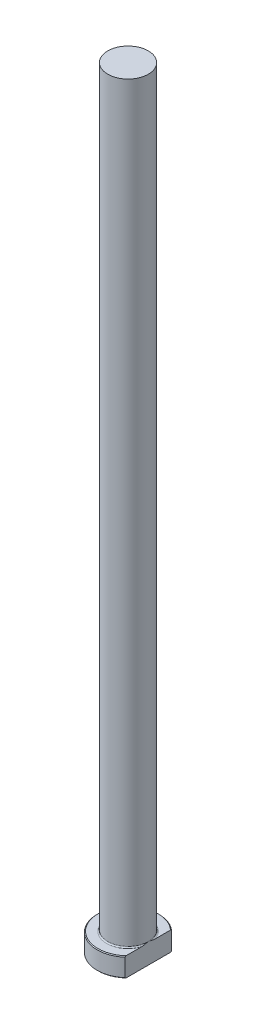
ISO-10303-21;
HEADER;
FILE_DESCRIPTION(('STEP AP214'),'2;1');
FILE_NAME('part.step','',(''),(''),'','','');
FILE_SCHEMA(('AUTOMOTIVE_DESIGN { 1 0 10303 214 1 1 1 1 }'));
ENDSEC;
DATA;
#1=APPLICATION_CONTEXT('core data for automotive mechanical design processes');
#2=APPLICATION_PROTOCOL_DEFINITION('international standard','automotive_design',2000,#1);
#3=PRODUCT_CONTEXT('',#1,'mechanical');
#4=PRODUCT('Part','Part','',(#3));
#5=PRODUCT_RELATED_PRODUCT_CATEGORY('part','',(#4));
#6=PRODUCT_DEFINITION_FORMATION('','',#4);
#7=PRODUCT_DEFINITION_CONTEXT('part definition',#1,'design');
#8=PRODUCT_DEFINITION('design','',#6,#7);
#9=PRODUCT_DEFINITION_SHAPE('','',#8);
#10=(LENGTH_UNIT() NAMED_UNIT(*) SI_UNIT(.MILLI.,.METRE.));
#11=(NAMED_UNIT(*) PLANE_ANGLE_UNIT() SI_UNIT($,.RADIAN.));
#12=(NAMED_UNIT(*) SI_UNIT($,.STERADIAN.) SOLID_ANGLE_UNIT());
#13=UNCERTAINTY_MEASURE_WITH_UNIT(LENGTH_MEASURE(1.E-05),#10,'distance_accuracy_value','');
#14=(GEOMETRIC_REPRESENTATION_CONTEXT(3) GLOBAL_UNCERTAINTY_ASSIGNED_CONTEXT((#13)) GLOBAL_UNIT_ASSIGNED_CONTEXT((#10,
#11,#12)) REPRESENTATION_CONTEXT('',''));
#15=CARTESIAN_POINT('',(0.,0.,0.));
#16=DIRECTION('',(0.,0.,1.));
#17=DIRECTION('',(1.,0.,0.));
#18=AXIS2_PLACEMENT_3D('',#15,#16,#17);
#19=CARTESIAN_POINT('',(0.,0.,0.));
#20=DIRECTION('',(0.,-1.,0.));
#21=DIRECTION('',(0.,0.,-1.));
#22=AXIS2_PLACEMENT_3D('',#19,#20,#21);
#23=PLANE('',#22);
#24=CARTESIAN_POINT('',(0.,0.,0.));
#25=DIRECTION('',(0.,-1.,0.));
#26=DIRECTION('',(0.,0.,-1.));
#27=AXIS2_PLACEMENT_3D('',#24,#25,#26);
#28=CIRCLE('',#27,7.79999999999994);
#29=CARTESIAN_POINT('',(5.24999999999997,0.,5.76866535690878));
#30=VERTEX_POINT('',#29);
#31=CARTESIAN_POINT('',(5.24999999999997,0.,-5.76866535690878));
#32=VERTEX_POINT('',#31);
#33=EDGE_CURVE('E98',#30,#32,#28,.T.);
#34=ORIENTED_EDGE('',*,*,#33,.T.);
#35=DIRECTION('',(0.,0.,1.));
#36=VECTOR('',#35,1.);
#37=CARTESIAN_POINT('',(5.24999999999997,0.,-6.0363482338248));
#38=LINE('',#37,#36);
#39=EDGE_CURVE('E83',#32,#30,#38,.T.);
#40=ORIENTED_EDGE('',*,*,#39,.T.);
#41=EDGE_LOOP('',(#34,#40));
#42=FACE_BOUND('',#41,.T.);
#43=ADVANCED_FACE('F32',(#42),#23,.T.);
#44=CARTESIAN_POINT('',(0.,259.958771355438,0.));
#45=DIRECTION('',(0.,1.,0.));
#46=DIRECTION('',(0.,0.,1.));
#47=AXIS2_PLACEMENT_3D('',#44,#45,#46);
#48=CYLINDRICAL_SURFACE('',#47,7.99999999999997);
#49=CARTESIAN_POINT('',(0.,4.80000000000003,0.));
#50=DIRECTION('',(0.,1.,0.));
#51=DIRECTION('',(0.,0.,1.));
#52=AXIS2_PLACEMENT_3D('',#49,#50,#51);
#53=CIRCLE('',#52,7.99999999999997);
#54=CARTESIAN_POINT('',(5.24999999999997,4.80000000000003,6.0363482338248));
#55=VERTEX_POINT('',#54);
#56=CARTESIAN_POINT('',(5.24999999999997,4.80000000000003,-6.0363482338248));
#57=VERTEX_POINT('',#56);
#58=EDGE_CURVE('E104',#55,#57,#53,.F.);
#59=ORIENTED_EDGE('',*,*,#58,.T.);
#60=DIRECTION('',(0.,-1.,0.));
#61=VECTOR('',#60,1.);
#62=CARTESIAN_POINT('',(5.24999999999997,200.,-6.0363482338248));
#63=LINE('',#62,#61);
#64=CARTESIAN_POINT('',(5.24999999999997,0.200000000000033,-6.0363482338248));
#65=VERTEX_POINT('',#64);
#66=EDGE_CURVE('E183',#57,#65,#63,.T.);
#67=ORIENTED_EDGE('',*,*,#66,.T.);
#68=CARTESIAN_POINT('',(0.,0.200000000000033,0.));
#69=DIRECTION('',(0.,-1.,0.));
#70=DIRECTION('',(0.,0.,-1.));
#71=AXIS2_PLACEMENT_3D('',#68,#69,#70);
#72=CIRCLE('',#71,7.99999999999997);
#73=CARTESIAN_POINT('',(5.24999999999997,0.200000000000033,6.0363482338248));
#74=VERTEX_POINT('',#73);
#75=EDGE_CURVE('E100',#65,#74,#72,.F.);
#76=ORIENTED_EDGE('',*,*,#75,.T.);
#77=DIRECTION('',(0.,-1.,0.));
#78=VECTOR('',#77,1.);
#79=CARTESIAN_POINT('',(5.24999999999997,200.,6.0363482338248));
#80=LINE('',#79,#78);
#81=EDGE_CURVE('E93',#55,#74,#80,.T.);
#82=ORIENTED_EDGE('',*,*,#81,.F.);
#83=EDGE_LOOP('',(#59,#67,#76,#82));
#84=FACE_BOUND('',#83,.T.);
#85=ADVANCED_FACE('F158',(#84),#48,.T.);
#86=CARTESIAN_POINT('',(-7.99999999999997,5.,0.));
#87=DIRECTION('',(0.,1.,0.));
#88=DIRECTION('',(0.,0.,1.));
#89=AXIS2_PLACEMENT_3D('',#86,#87,#88);
#90=PLANE('',#89);
#91=CARTESIAN_POINT('',(0.,5.,0.));
#92=DIRECTION('',(0.,1.,0.));
#93=DIRECTION('',(0.,0.,1.));
#94=AXIS2_PLACEMENT_3D('',#91,#92,#93);
#95=CIRCLE('',#94,7.79999999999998);
#96=CARTESIAN_POINT('',(5.24999999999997,5.,-5.76866535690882));
#97=VERTEX_POINT('',#96);
#98=CARTESIAN_POINT('',(5.24999999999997,5.,5.76866535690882));
#99=VERTEX_POINT('',#98);
#100=EDGE_CURVE('E178',#97,#99,#95,.T.);
#101=ORIENTED_EDGE('',*,*,#100,.T.);
#102=DIRECTION('',(0.,0.,-1.));
#103=VECTOR('',#102,1.);
#104=CARTESIAN_POINT('',(5.24999999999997,5.,0.));
#105=LINE('',#104,#103);
#106=CARTESIAN_POINT('',(5.24999999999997,4.99999999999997,1.79999999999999));
#107=VERTEX_POINT('',#106);
#108=EDGE_CURVE('E57',#99,#107,#105,.T.);
#109=ORIENTED_EDGE('',*,*,#108,.T.);
#110=CARTESIAN_POINT('',(0.,5.,0.));
#111=DIRECTION('',(0.,1.,0.));
#112=DIRECTION('',(0.,0.,1.));
#113=AXIS2_PLACEMENT_3D('',#110,#111,#112);
#114=CIRCLE('',#113,5.54999999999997);
#115=CARTESIAN_POINT('',(5.24999999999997,4.99999999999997,-1.79999999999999));
#116=VERTEX_POINT('',#115);
#117=EDGE_CURVE('E107',#107,#116,#114,.F.);
#118=ORIENTED_EDGE('',*,*,#117,.T.);
#119=EDGE_CURVE('E136',#116,#97,#105,.T.);
#120=ORIENTED_EDGE('',*,*,#119,.T.);
#121=EDGE_LOOP('',(#101,#109,#118,#120));
#122=FACE_BOUND('',#121,.T.);
#123=ADVANCED_FACE('F147',(#122),#90,.T.);
#124=CARTESIAN_POINT('',(0.,5.,0.));
#125=DIRECTION('',(0.,-1.,0.));
#126=DIRECTION('',(0.,0.,-1.));
#127=AXIS2_PLACEMENT_3D('',#124,#125,#126);
#128=CONICAL_SURFACE('',#127,7.79999999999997,0.785398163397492);
#129=ORIENTED_EDGE('',*,*,#58,.F.);
#130=CARTESIAN_POINT('',(5.24999999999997,-1.48116632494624,13.2811600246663));
#131=CARTESIAN_POINT('',(5.24999999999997,-1.29357250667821,13.0794377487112));
#132=CARTESIAN_POINT('',(5.24999999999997,-1.10628451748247,12.8774311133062));
#133=CARTESIAN_POINT('',(5.24999999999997,-0.732415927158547,12.4727618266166));
#134=CARTESIAN_POINT('',(5.24999999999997,-0.545835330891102,12.2700991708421));
#135=CARTESIAN_POINT('',(5.24999999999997,0.0127787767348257,11.6609122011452));
#136=CARTESIAN_POINT('',(5.24999999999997,0.383603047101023,11.2532764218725));
#137=CARTESIAN_POINT('',(5.24999999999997,1.12325341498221,10.4315008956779));
#138=CARTESIAN_POINT('',(5.24999999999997,1.49205195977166,10.017336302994));
#139=CARTESIAN_POINT('',(5.24999999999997,2.22349880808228,9.18368237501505));
#140=CARTESIAN_POINT('',(5.24999999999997,2.58614786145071,8.7641936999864));
#141=CARTESIAN_POINT('',(5.24999999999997,3.2300874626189,8.00331710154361));
#142=CARTESIAN_POINT('',(5.24999999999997,3.51299211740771,7.66330157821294));
#143=CARTESIAN_POINT('',(5.24999999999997,3.93141579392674,7.1483720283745));
#144=CARTESIAN_POINT('',(5.24999999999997,4.06992138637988,6.97588542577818));
#145=CARTESIAN_POINT('',(5.24999999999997,4.34452705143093,6.62901010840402));
#146=CARTESIAN_POINT('',(5.24999999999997,4.48062717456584,6.45462143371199));
#147=CARTESIAN_POINT('',(5.24999999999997,4.74973822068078,6.10383934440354));
#148=CARTESIAN_POINT('',(5.24999999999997,4.88275300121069,5.92744889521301));
#149=CARTESIAN_POINT('',(5.24999999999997,5.14521399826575,5.57203856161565));
#150=CARTESIAN_POINT('',(5.24999999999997,5.27466038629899,5.39301880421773));
#151=CARTESIAN_POINT('',(5.24999999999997,5.5290748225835,5.03192492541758));
#152=CARTESIAN_POINT('',(5.24999999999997,5.65404469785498,4.84985209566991));
#153=CARTESIAN_POINT('',(5.24999999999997,5.89840426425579,4.48201214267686));
#154=CARTESIAN_POINT('',(5.24999999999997,6.01779462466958,4.29624546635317));
#155=CARTESIAN_POINT('',(5.24999999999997,6.24171029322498,3.93290441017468));
#156=CARTESIAN_POINT('',(5.24999999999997,6.34669562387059,3.75561494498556));
#157=CARTESIAN_POINT('',(5.24999999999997,6.5488301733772,3.39656407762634));
#158=CARTESIAN_POINT('',(5.24999999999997,6.64597853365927,3.21480218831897));
#159=CARTESIAN_POINT('',(5.24999999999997,6.83020392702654,2.84629933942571));
#160=CARTESIAN_POINT('',(5.24999999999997,6.91728535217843,2.65956059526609));
#161=CARTESIAN_POINT('',(5.24999999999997,7.07861709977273,2.28058919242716));
#162=CARTESIAN_POINT('',(5.24999999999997,7.15287080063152,2.08835799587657));
#163=CARTESIAN_POINT('',(5.24999999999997,7.27107095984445,1.73993363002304));
#164=CARTESIAN_POINT('',(5.24999999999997,7.31810380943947,1.58479376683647));
#165=CARTESIAN_POINT('',(5.24999999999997,7.40035184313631,1.27142880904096));
#166=CARTESIAN_POINT('',(5.24999999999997,7.43557139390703,1.11320487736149));
#167=CARTESIAN_POINT('',(5.24999999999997,7.49247262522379,0.794842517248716));
#168=CARTESIAN_POINT('',(5.24999999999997,7.5141983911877,0.634712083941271));
#169=CARTESIAN_POINT('',(5.24999999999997,7.5431070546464,0.313132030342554));
#170=CARTESIAN_POINT('',(5.24999999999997,7.55029089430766,0.151682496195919));
#171=CARTESIAN_POINT('',(5.24999999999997,7.54968998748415,-0.1717266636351));
#172=CARTESIAN_POINT('',(5.24999999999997,7.54185529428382,-0.333686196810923));
#173=CARTESIAN_POINT('',(5.24999999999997,7.5115849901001,-0.656223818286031));
#174=CARTESIAN_POINT('',(5.24999999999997,7.48914825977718,-0.816801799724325));
#175=CARTESIAN_POINT('',(5.24999999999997,7.43080718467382,-1.13597880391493));
#176=CARTESIAN_POINT('',(5.24999999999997,7.39486058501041,-1.29456998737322));
#177=CARTESIAN_POINT('',(5.24999999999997,7.31118363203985,-1.60857875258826));
#178=CARTESIAN_POINT('',(5.24999999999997,7.26345259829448,-1.76399615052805));
#179=CARTESIAN_POINT('',(5.24999999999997,7.15315151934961,-2.08548717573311));
#180=CARTESIAN_POINT('',(5.24999999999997,7.08962117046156,-2.25122835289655));
#181=CARTESIAN_POINT('',(5.24999999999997,6.95279918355,-2.57864196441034));
#182=CARTESIAN_POINT('',(5.24999999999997,6.87950469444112,-2.74031319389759));
#183=CARTESIAN_POINT('',(5.24999999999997,6.72489088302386,-3.06007692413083));
#184=CARTESIAN_POINT('',(5.24999999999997,6.64355831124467,-3.21816296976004));
#185=CARTESIAN_POINT('',(5.24999999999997,6.47449809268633,-3.53083072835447));
#186=CARTESIAN_POINT('',(5.24999999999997,6.38677122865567,-3.68541286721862));
#187=CARTESIAN_POINT('',(5.24999999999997,6.20495786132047,-3.99346169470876));
#188=CARTESIAN_POINT('',(5.24999999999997,6.110804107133,-4.14688850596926));
#189=CARTESIAN_POINT('',(5.24999999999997,5.91814750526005,-4.45098066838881));
#190=CARTESIAN_POINT('',(5.24999999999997,5.81964456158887,-4.60164595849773));
#191=CARTESIAN_POINT('',(5.24999999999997,5.61916095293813,-4.90042904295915));
#192=CARTESIAN_POINT('',(5.24999999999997,5.51718369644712,-5.04854913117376));
#193=CARTESIAN_POINT('',(5.24999999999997,5.31027155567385,-5.3427009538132));
#194=CARTESIAN_POINT('',(5.24999999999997,5.20533670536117,-5.48873271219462));
#195=CARTESIAN_POINT('',(5.24999999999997,4.97106981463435,-5.80895105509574));
#196=CARTESIAN_POINT('',(5.24999999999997,4.84117419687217,-5.98272485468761));
#197=CARTESIAN_POINT('',(5.24999999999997,4.57844088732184,-6.32803694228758));
#198=CARTESIAN_POINT('',(5.24999999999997,4.44560309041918,-6.49957515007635));
#199=CARTESIAN_POINT('',(5.24999999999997,4.04344241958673,-7.01138747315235));
#200=CARTESIAN_POINT('',(5.24999999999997,3.77050218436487,-7.34881891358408));
#201=CARTESIAN_POINT('',(5.24999999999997,3.21761339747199,-8.01842681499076));
#202=CARTESIAN_POINT('',(5.24999999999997,2.93765803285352,-8.35059761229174));
#203=CARTESIAN_POINT('',(5.24999999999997,2.37280482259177,-9.01071908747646));
#204=CARTESIAN_POINT('',(5.24999999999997,2.08790682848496,-9.338669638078));
#205=CARTESIAN_POINT('',(5.24999999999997,1.53221513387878,-9.97104652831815));
#206=CARTESIAN_POINT('',(5.24999999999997,1.26164416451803,-10.2756690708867));
#207=CARTESIAN_POINT('',(5.24999999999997,0.717945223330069,-10.8826342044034));
#208=CARTESIAN_POINT('',(5.24999999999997,0.44481719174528,-11.184976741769));
#209=CARTESIAN_POINT('',(5.24999999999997,-0.102863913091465,-11.7871569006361));
#210=CARTESIAN_POINT('',(5.24999999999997,-0.377412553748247,-12.0869985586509));
#211=CARTESIAN_POINT('',(5.24999999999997,-0.928148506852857,-12.6851474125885));
#212=CARTESIAN_POINT('',(5.24999999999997,-1.20433574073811,-12.9834546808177));
#213=CARTESIAN_POINT('',(5.24999999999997,-1.48116632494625,-13.2811600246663));
#214=B_SPLINE_CURVE_WITH_KNOTS('',3,(#130,#131,#132,#133,#134,#135,#136,#137,#138,#139,#140,
#141,#142,#143,#144,#145,#146,#147,#148,#149,#150,#151,#152,#153,#154,#155,#156,#157,#158,#159,
#160,#161,#162,#163,#164,#165,#166,#167,#168,#169,#170,#171,#172,#173,#174,#175,#176,#177,#178,
#179,#180,#181,#182,#183,#184,#185,#186,#187,#188,#189,#190,#191,#192,#193,#194,#195,#196,#197,
#198,#199,#200,#201,#202,#203,#204,#205,#206,#207,#208,#209,#210,#211,#212,#213),.UNSPECIFIED.,
.F.,.F.,(4,2,2,2,2,2,2,2,2,2,2,2,2,2,2,2,2,2,2,2,2,2,2,2,2,2,2,2,2,2,2,2,2,2,2,2,2,2,2,2,2,4),
(0.,0.826407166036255,1.65282000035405,3.30600459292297,4.9696651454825,6.63312135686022,
7.9599789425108,8.62360280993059,9.2872127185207,9.94994254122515,10.6126404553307,
11.2750647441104,11.9374093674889,12.555381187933,13.1734206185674,13.7911893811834,
14.4087951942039,14.8947423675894,15.3805097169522,15.8646815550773,16.3488220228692,
16.8345753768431,17.3203659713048,17.8076887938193,18.2950397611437,18.8271554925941,
19.3594269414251,19.8925908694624,20.4256896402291,20.9656407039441,21.5056036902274,
22.0450513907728,22.5844928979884,23.2353229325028,23.8861762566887,25.1880335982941,
26.4912084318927,27.7944224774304,29.0167115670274,30.2390292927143,31.4586693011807,
32.6782512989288),.UNSPECIFIED.);
#215=EDGE_CURVE('E135',#55,#99,#214,.T.);
#216=ORIENTED_EDGE('',*,*,#215,.T.);
#217=ORIENTED_EDGE('',*,*,#100,.F.);
#218=EDGE_CURVE('E127',#97,#57,#214,.T.);
#219=ORIENTED_EDGE('',*,*,#218,.T.);
#220=EDGE_LOOP('',(#129,#216,#217,#219));
#221=FACE_BOUND('',#220,.T.);
#222=ADVANCED_FACE('F143',(#221),#128,.T.);
#223=CARTESIAN_POINT('',(0.,0.200000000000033,0.));
#224=DIRECTION('',(0.,1.,0.));
#225=DIRECTION('',(0.,0.,1.));
#226=AXIS2_PLACEMENT_3D('',#223,#224,#225);
#227=CONICAL_SURFACE('',#226,7.99999999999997,0.785398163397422);
#228=ORIENTED_EDGE('',*,*,#75,.F.);
#229=CARTESIAN_POINT('',(5.24999999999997,6.48116632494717,-13.2811600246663));
#230=CARTESIAN_POINT('',(5.24999999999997,6.29357250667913,-13.0794377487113));
#231=CARTESIAN_POINT('',(5.24999999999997,6.10628451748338,-12.8774311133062));
#232=CARTESIAN_POINT('',(5.24999999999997,5.73241592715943,-12.4727618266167));
#233=CARTESIAN_POINT('',(5.24999999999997,5.54583533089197,-12.2700991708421));
#234=CARTESIAN_POINT('',(5.24999999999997,4.98722122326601,-11.6609122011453));
#235=CARTESIAN_POINT('',(5.24999999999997,4.61639695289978,-11.2532764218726));
#236=CARTESIAN_POINT('',(5.24999999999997,3.87674658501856,-10.4315008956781));
#237=CARTESIAN_POINT('',(5.24999999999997,3.50794804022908,-10.0173363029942));
#238=CARTESIAN_POINT('',(5.24999999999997,2.77650119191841,-9.18368237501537));
#239=CARTESIAN_POINT('',(5.24999999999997,2.41385213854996,-8.76419369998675));
#240=CARTESIAN_POINT('',(5.24999999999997,1.76991253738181,-8.00331710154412));
#241=CARTESIAN_POINT('',(5.24999999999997,1.48700788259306,-7.66330157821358));
#242=CARTESIAN_POINT('',(5.24999999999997,1.06858420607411,-7.14837202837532));
#243=CARTESIAN_POINT('',(5.24999999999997,0.930078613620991,-6.97588542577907));
#244=CARTESIAN_POINT('',(5.24999999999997,0.655472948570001,-6.62901010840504));
#245=CARTESIAN_POINT('',(5.24999999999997,0.519372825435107,-6.45462143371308));
#246=CARTESIAN_POINT('',(5.24999999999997,0.250261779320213,-6.10383934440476));
#247=CARTESIAN_POINT('',(5.24999999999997,0.117246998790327,-5.9274488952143));
#248=CARTESIAN_POINT('',(5.24999999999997,-0.145213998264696,-5.57203856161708));
#249=CARTESIAN_POINT('',(5.24999999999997,-0.274660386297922,-5.39301880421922));
#250=CARTESIAN_POINT('',(5.24999999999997,-0.529074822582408,-5.03192492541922));
#251=CARTESIAN_POINT('',(5.24999999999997,-0.654044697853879,-4.84985209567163));
#252=CARTESIAN_POINT('',(5.24999999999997,-0.898404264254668,-4.48201214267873));
#253=CARTESIAN_POINT('',(5.24999999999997,-1.01779462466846,-4.29624546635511));
#254=CARTESIAN_POINT('',(5.24999999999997,-1.24171029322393,-3.93290441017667));
#255=CARTESIAN_POINT('',(5.24999999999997,-1.34669562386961,-3.75561494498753));
#256=CARTESIAN_POINT('',(5.24999999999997,-1.54883017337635,-3.39656407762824));
#257=CARTESIAN_POINT('',(5.24999999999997,-1.64597853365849,-3.21480218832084));
#258=CARTESIAN_POINT('',(5.24999999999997,-1.8302039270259,-2.84629933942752));
#259=CARTESIAN_POINT('',(5.24999999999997,-1.91728535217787,-2.65956059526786));
#260=CARTESIAN_POINT('',(5.24999999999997,-2.07861709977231,-2.28058919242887));
#261=CARTESIAN_POINT('',(5.24999999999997,-2.15287080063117,-2.08835799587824));
#262=CARTESIAN_POINT('',(5.24999999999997,-2.27107095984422,-1.73993363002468));
#263=CARTESIAN_POINT('',(5.24999999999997,-2.31810380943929,-1.58479376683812));
#264=CARTESIAN_POINT('',(5.24999999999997,-2.40035184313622,-1.27142880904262));
#265=CARTESIAN_POINT('',(5.24999999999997,-2.43557139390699,-1.11320487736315));
#266=CARTESIAN_POINT('',(5.24999999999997,-2.49247262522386,-0.794842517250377));
#267=CARTESIAN_POINT('',(5.24999999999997,-2.51419839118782,-0.63471208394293));
#268=CARTESIAN_POINT('',(5.24999999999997,-2.54310705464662,-0.313132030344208));
#269=CARTESIAN_POINT('',(5.24999999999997,-2.55029089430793,-0.151682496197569));
#270=CARTESIAN_POINT('',(5.24999999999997,-2.54968998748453,0.171726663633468));
#271=CARTESIAN_POINT('',(5.24999999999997,-2.54185529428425,0.333686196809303));
#272=CARTESIAN_POINT('',(5.24999999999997,-2.51158499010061,0.656223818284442));
#273=CARTESIAN_POINT('',(5.24999999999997,-2.48914825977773,0.816801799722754));
#274=CARTESIAN_POINT('',(5.24999999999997,-2.43080718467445,1.1359788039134));
#275=CARTESIAN_POINT('',(5.24999999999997,-2.39486058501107,1.2945699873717));
#276=CARTESIAN_POINT('',(5.24999999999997,-2.31118363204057,1.60857875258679));
#277=CARTESIAN_POINT('',(5.24999999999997,-2.26345259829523,1.7639961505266));
#278=CARTESIAN_POINT('',(5.24999999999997,-2.15315151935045,2.08548717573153));
#279=CARTESIAN_POINT('',(5.24999999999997,-2.0896211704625,2.25122835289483));
#280=CARTESIAN_POINT('',(5.24999999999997,-1.95279918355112,2.57864196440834));
#281=CARTESIAN_POINT('',(5.24999999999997,-1.87950469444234,2.74031319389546));
#282=CARTESIAN_POINT('',(5.24999999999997,-1.72489088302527,3.06007692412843));
#283=CARTESIAN_POINT('',(5.24999999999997,-1.64355831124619,3.21816296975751));
#284=CARTESIAN_POINT('',(5.24999999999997,-1.47449809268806,3.53083072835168));
#285=CARTESIAN_POINT('',(5.24999999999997,-1.38677122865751,3.68541286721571));
#286=CARTESIAN_POINT('',(5.24999999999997,-1.20495786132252,3.99346169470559));
#287=CARTESIAN_POINT('',(5.24999999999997,-1.11080410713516,4.14688850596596));
#288=CARTESIAN_POINT('',(5.24999999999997,-0.918147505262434,4.45098066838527));
#289=CARTESIAN_POINT('',(5.24999999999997,-0.81964456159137,4.60164595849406));
#290=CARTESIAN_POINT('',(5.24999999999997,-0.619160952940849,4.90042904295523));
#291=CARTESIAN_POINT('',(5.24999999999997,-0.517183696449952,5.04854913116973));
#292=CARTESIAN_POINT('',(5.24999999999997,-0.310271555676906,5.34270095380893));
#293=CARTESIAN_POINT('',(5.24999999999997,-0.205336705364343,5.48873271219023));
#294=CARTESIAN_POINT('',(5.24999999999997,0.0289301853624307,5.80895105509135));
#295=CARTESIAN_POINT('',(5.24999999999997,0.158825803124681,5.98272485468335));
#296=CARTESIAN_POINT('',(5.24999999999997,0.421559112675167,6.32803694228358));
#297=CARTESIAN_POINT('',(5.24999999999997,0.554396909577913,6.49957515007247));
#298=CARTESIAN_POINT('',(5.24999999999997,0.956557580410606,7.01138747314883));
#299=CARTESIAN_POINT('',(5.24999999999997,1.22949781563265,7.34881891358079));
#300=CARTESIAN_POINT('',(5.24999999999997,1.78238660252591,8.01842681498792));
#301=CARTESIAN_POINT('',(5.24999999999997,2.06234196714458,8.35059761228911));
#302=CARTESIAN_POINT('',(5.24999999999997,2.62719517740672,9.01071908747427));
#303=CARTESIAN_POINT('',(5.24999999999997,2.91209317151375,9.33866963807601));
#304=CARTESIAN_POINT('',(5.24999999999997,3.4677848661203,9.97104652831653));
#305=CARTESIAN_POINT('',(5.24999999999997,3.73835583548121,10.2756690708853));
#306=CARTESIAN_POINT('',(5.24999999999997,4.28205477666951,10.8826342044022));
#307=CARTESIAN_POINT('',(5.24999999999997,4.55518280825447,11.184976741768));
#308=CARTESIAN_POINT('',(5.24999999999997,5.10286391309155,11.7871569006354));
#309=CARTESIAN_POINT('',(5.24999999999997,5.3774125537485,12.0869985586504));
#310=CARTESIAN_POINT('',(5.24999999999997,5.92814850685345,12.6851474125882));
#311=CARTESIAN_POINT('',(5.24999999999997,6.20433574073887,12.9834546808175));
#312=CARTESIAN_POINT('',(5.24999999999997,6.48116632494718,13.2811600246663));
#313=B_SPLINE_CURVE_WITH_KNOTS('',3,(#229,#230,#231,#232,#233,#234,#235,#236,#237,#238,#239,
#240,#241,#242,#243,#244,#245,#246,#247,#248,#249,#250,#251,#252,#253,#254,#255,#256,#257,#258,
#259,#260,#261,#262,#263,#264,#265,#266,#267,#268,#269,#270,#271,#272,#273,#274,#275,#276,#277,
#278,#279,#280,#281,#282,#283,#284,#285,#286,#287,#288,#289,#290,#291,#292,#293,#294,#295,#296,
#297,#298,#299,#300,#301,#302,#303,#304,#305,#306,#307,#308,#309,#310,#311,#312),.UNSPECIFIED.,
.F.,.F.,(4,2,2,2,2,2,2,2,2,2,2,2,2,2,2,2,2,2,2,2,2,2,2,2,2,2,2,2,2,2,2,2,2,2,2,2,2,2,2,2,2,4),
(0.,0.826407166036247,1.65282000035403,3.30600459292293,4.96966514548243,6.63312135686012,
7.9599789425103,8.62360280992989,9.28721271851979,9.94994254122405,10.6126404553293,
11.2750647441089,11.9374093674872,12.5553811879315,13.1734206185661,13.7911893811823,
14.4087951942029,14.8947423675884,15.3805097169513,15.8646815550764,16.3488220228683,
16.8345753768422,17.320365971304,17.8076887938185,18.2950397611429,18.8271554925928,
19.3594269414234,19.8925908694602,20.4256896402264,20.9656407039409,21.5056036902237,
22.0450513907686,22.5844928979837,23.2353229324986,23.8861762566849,25.1880335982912,
26.4912084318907,27.7944224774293,29.0167115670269,30.2390292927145,31.4586693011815,
32.6782512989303),.UNSPECIFIED.);
#314=EDGE_CURVE('E86',#65,#32,#313,.T.);
#315=ORIENTED_EDGE('',*,*,#314,.T.);
#316=ORIENTED_EDGE('',*,*,#33,.F.);
#317=EDGE_CURVE('E89',#30,#74,#313,.T.);
#318=ORIENTED_EDGE('',*,*,#317,.T.);
#319=EDGE_LOOP('',(#228,#315,#316,#318));
#320=FACE_BOUND('',#319,.T.);
#321=ADVANCED_FACE('F97',(#320),#227,.T.);
#322=CARTESIAN_POINT('',(0.,5.29999999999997,0.));
#323=DIRECTION('',(0.,1.,0.));
#324=DIRECTION('',(0.,0.,1.));
#325=AXIS2_PLACEMENT_3D('',#322,#323,#324);
#326=TOROIDAL_SURFACE('',#325,5.54999999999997,0.3);
#327=CARTESIAN_POINT('',(5.24999999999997,5.29999999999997,0.));
#328=CARTESIAN_POINT('',(5.24999999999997,5.30000062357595,1.16656166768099E-10));
#329=CARTESIAN_POINT('',(5.24999999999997,5.30000124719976,-2.61240012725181E-07));
#330=CARTESIAN_POINT('',(5.24999999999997,5.30000240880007,-9.73737247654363E-07));
#331=CARTESIAN_POINT('',(5.24999999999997,5.3000029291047,-1.44300381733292E-06));
#332=CARTESIAN_POINT('',(5.24999999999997,5.30000402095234,-2.56984529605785E-06));
#333=CARTESIAN_POINT('',(5.24999999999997,5.30000457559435,-3.24572224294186E-06));
#334=CARTESIAN_POINT('',(5.24999999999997,5.30000555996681,-4.63899443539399E-06));
#335=CARTESIAN_POINT('',(5.24999999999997,5.30000599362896,-5.35385174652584E-06));
#336=CARTESIAN_POINT('',(5.24999999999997,5.30000762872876,-8.15275638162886E-06));
#337=CARTESIAN_POINT('',(5.24999999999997,5.30000874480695,-1.02903375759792E-05));
#338=CARTESIAN_POINT('',(5.24999999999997,5.30001055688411,-1.44997307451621E-05));
#339=CARTESIAN_POINT('',(5.24999999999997,5.30001128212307,-1.65594410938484E-05));
#340=CARTESIAN_POINT('',(5.24999999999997,5.30001436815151,-2.53621688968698E-05));
#341=CARTESIAN_POINT('',(5.24999999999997,5.30001670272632,-3.21176555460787E-05));
#342=CARTESIAN_POINT('',(5.24999999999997,5.30002009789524,-4.48185660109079E-05));
#343=CARTESIAN_POINT('',(5.24999999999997,5.30002130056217,-5.07256098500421E-05));
#344=CARTESIAN_POINT('',(5.24999999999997,5.300030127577,-9.48741140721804E-05));
#345=CARTESIAN_POINT('',(5.24999999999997,5.30003689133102,-0.000133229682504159));
#346=CARTESIAN_POINT('',(5.24999999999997,5.30006649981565,-0.00028531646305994));
#347=CARTESIAN_POINT('',(5.24999999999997,5.30009467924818,-0.000398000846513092));
#348=CARTESIAN_POINT('',(5.24999999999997,5.30020485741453,-0.000845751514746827));
#349=CARTESIAN_POINT('',(5.24999999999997,5.30028346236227,-0.00118137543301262));
#350=CARTESIAN_POINT('',(5.24999999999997,5.30059922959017,-0.00251998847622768));
#351=CARTESIAN_POINT('',(5.24999999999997,5.30084070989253,-0.0035222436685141));
#352=CARTESIAN_POINT('',(5.24999999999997,5.3018480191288,-0.00771382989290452));
#353=CARTESIAN_POINT('',(5.24999999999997,5.30260840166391,-0.0109040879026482));
#354=CARTESIAN_POINT('',(5.24999999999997,5.30980219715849,-0.0410723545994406));
#355=CARTESIAN_POINT('',(5.24999999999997,5.31625953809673,-0.0680464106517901));
#356=CARTESIAN_POINT('',(5.24999999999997,5.32887570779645,-0.120910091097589));
#357=CARTESIAN_POINT('',(5.24999999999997,5.33503603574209,-0.146799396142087));
#358=CARTESIAN_POINT('',(5.24999999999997,5.34810832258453,-0.201908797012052));
#359=CARTESIAN_POINT('',(5.24999999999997,5.35501531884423,-0.231130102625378));
#360=CARTESIAN_POINT('',(5.24999999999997,5.3688279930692,-0.289915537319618));
#361=CARTESIAN_POINT('',(5.24999999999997,5.37573280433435,-0.31947986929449));
#362=CARTESIAN_POINT('',(5.24999999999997,5.39233240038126,-0.391129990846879));
#363=CARTESIAN_POINT('',(5.24999999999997,5.40197331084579,-0.433228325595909));
#364=CARTESIAN_POINT('',(5.24999999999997,5.42071775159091,-0.516417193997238));
#365=CARTESIAN_POINT('',(5.24999999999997,5.42982871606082,-0.557506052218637));
#366=CARTESIAN_POINT('',(5.24999999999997,5.45024545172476,-0.651521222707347));
#367=CARTESIAN_POINT('',(5.24999999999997,5.46143398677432,-0.70447326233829));
#368=CARTESIAN_POINT('',(5.24999999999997,5.48311687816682,-0.810941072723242));
#369=CARTESIAN_POINT('',(5.24999999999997,5.49360525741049,-0.864458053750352));
#370=CARTESIAN_POINT('',(5.24999999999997,5.5252275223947,-1.03405951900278));
#371=CARTESIAN_POINT('',(5.24999999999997,5.54454970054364,-1.15049679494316));
#372=CARTESIAN_POINT('',(5.24999999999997,5.57371765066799,-1.36731361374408));
#373=CARTESIAN_POINT('',(5.24999999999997,5.58453543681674,-1.4675540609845));
#374=CARTESIAN_POINT('',(5.24999999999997,5.59494335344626,-1.61734655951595));
#375=CARTESIAN_POINT('',(5.24999999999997,5.5974458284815,-1.66669122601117));
#376=CARTESIAN_POINT('',(5.24999999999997,5.60018139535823,-1.76542367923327));
#377=CARTESIAN_POINT('',(5.24999999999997,5.60041538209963,-1.81481144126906));
#378=CARTESIAN_POINT('',(5.24999999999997,5.59770699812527,-1.92992281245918));
#379=CARTESIAN_POINT('',(5.24999999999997,5.59368653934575,-1.99563731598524));
#380=CARTESIAN_POINT('',(5.24999999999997,5.58239535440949,-2.09375112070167));
#381=CARTESIAN_POINT('',(5.24999999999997,5.5777387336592,-2.12645109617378));
#382=CARTESIAN_POINT('',(5.24999999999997,5.56623568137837,-2.19145637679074));
#383=CARTESIAN_POINT('',(5.24999999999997,5.55939081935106,-2.22376194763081));
#384=CARTESIAN_POINT('',(5.24999999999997,5.54289171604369,-2.28774017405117));
#385=CARTESIAN_POINT('',(5.24999999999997,5.53323089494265,-2.31941115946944));
#386=CARTESIAN_POINT('',(5.24999999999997,5.5101870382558,-2.38130147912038));
#387=CARTESIAN_POINT('',(5.24999999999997,5.49682279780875,-2.41152726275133));
#388=CARTESIAN_POINT('',(5.24999999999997,5.47383686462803,-2.45267588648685));
#389=CARTESIAN_POINT('',(5.24999999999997,5.46640062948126,-2.46481176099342));
#390=CARTESIAN_POINT('',(5.24999999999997,5.45028535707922,-2.48829012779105));
#391=CARTESIAN_POINT('',(5.24999999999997,5.44160336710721,-2.49963063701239));
#392=CARTESIAN_POINT('',(5.24999999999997,5.42264067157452,-2.52121093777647));
#393=CARTESIAN_POINT('',(5.24999999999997,5.41233846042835,-2.53143222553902));
#394=CARTESIAN_POINT('',(5.24999999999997,5.39001295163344,-2.54977752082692));
#395=CARTESIAN_POINT('',(5.24999999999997,5.3779990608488,-2.55791235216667));
#396=CARTESIAN_POINT('',(5.24999999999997,5.35800000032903,-2.56805143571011));
#397=CARTESIAN_POINT('',(5.24999999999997,5.3505843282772,-2.57117564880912));
#398=CARTESIAN_POINT('',(5.24999999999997,5.33534289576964,-2.57618429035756));
#399=CARTESIAN_POINT('',(5.24999999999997,5.32751754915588,-2.57806994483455));
#400=CARTESIAN_POINT('',(5.24999999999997,5.311605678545,-2.58043009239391));
#401=CARTESIAN_POINT('',(5.24999999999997,5.3035179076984,-2.58089637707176));
#402=CARTESIAN_POINT('',(5.24999999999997,5.28739280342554,-2.58034271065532));
#403=CARTESIAN_POINT('',(5.24999999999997,5.27935547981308,-2.5793224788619));
#404=CARTESIAN_POINT('',(5.24999999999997,5.2641286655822,-2.576023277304));
#405=CARTESIAN_POINT('',(5.24999999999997,5.25691883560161,-2.57383545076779));
#406=CARTESIAN_POINT('',(5.24999999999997,5.24289768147,-2.56843751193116));
#407=CARTESIAN_POINT('',(5.24999999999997,5.23608651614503,-2.5652269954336));
#408=CARTESIAN_POINT('',(5.24999999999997,5.21908960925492,-2.55585712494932));
#409=CARTESIAN_POINT('',(5.24999999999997,5.20925106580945,-2.54906973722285));
#410=CARTESIAN_POINT('',(5.24999999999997,5.19074002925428,-2.53405361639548));
#411=CARTESIAN_POINT('',(5.24999999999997,5.1820713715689,-2.52582033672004));
#412=CARTESIAN_POINT('',(5.24999999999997,5.15973027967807,-2.50189565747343));
#413=CARTESIAN_POINT('',(5.24999999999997,5.14713154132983,-2.4852116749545));
#414=CARTESIAN_POINT('',(5.24999999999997,5.12441873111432,-2.45028247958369));
#415=CARTESIAN_POINT('',(5.24999999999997,5.11430835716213,-2.43203499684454));
#416=CARTESIAN_POINT('',(5.24999999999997,5.095460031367,-2.39348631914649));
#417=CARTESIAN_POINT('',(5.24999999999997,5.08684143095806,-2.3731276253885));
#418=CARTESIAN_POINT('',(5.24999999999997,5.07130293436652,-2.33176174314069));
#419=CARTESIAN_POINT('',(5.24999999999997,5.0643850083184,-2.31075383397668));
#420=CARTESIAN_POINT('',(5.24999999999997,5.05188132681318,-2.26814065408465));
#421=CARTESIAN_POINT('',(5.24999999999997,5.04630843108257,-2.24653166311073));
#422=CARTESIAN_POINT('',(5.24999999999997,5.036346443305,-2.20306277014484));
#423=CARTESIAN_POINT('',(5.24999999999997,5.03195656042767,-2.18120304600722));
#424=CARTESIAN_POINT('',(5.24999999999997,5.02182394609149,-2.12403914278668));
#425=CARTESIAN_POINT('',(5.24999999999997,5.01686753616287,-2.08859566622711));
#426=CARTESIAN_POINT('',(5.24999999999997,5.00900730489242,-2.01747645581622));
#427=CARTESIAN_POINT('',(5.24999999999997,5.0061045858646,-1.98180060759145));
#428=CARTESIAN_POINT('',(5.24999999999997,4.99990490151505,-1.87441007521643));
#429=CARTESIAN_POINT('',(5.24999999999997,4.99914942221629,-1.80254846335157));
#430=CARTESIAN_POINT('',(5.24999999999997,5.00239161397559,-1.66261916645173));
#431=CARTESIAN_POINT('',(5.24999999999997,5.00615102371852,-1.59454326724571));
#432=CARTESIAN_POINT('',(5.24999999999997,5.0170133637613,-1.45862908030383));
#433=CARTESIAN_POINT('',(5.24999999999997,5.02411815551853,-1.39079094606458));
#434=CARTESIAN_POINT('',(5.24999999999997,5.04416126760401,-1.22927166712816));
#435=CARTESIAN_POINT('',(5.24999999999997,5.05829298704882,-1.1357414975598));
#436=CARTESIAN_POINT('',(5.24999999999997,5.08230499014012,-0.994796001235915));
#437=CARTESIAN_POINT('',(5.24999999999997,5.09089456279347,-0.947150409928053));
#438=CARTESIAN_POINT('',(5.24999999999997,5.10886306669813,-0.851871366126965));
#439=CARTESIAN_POINT('',(5.24999999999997,5.11824411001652,-0.804238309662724));
#440=CARTESIAN_POINT('',(5.24999999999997,5.141356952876,-0.690797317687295));
#441=CARTESIAN_POINT('',(5.24999999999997,5.15537399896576,-0.625047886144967));
#442=CARTESIAN_POINT('',(5.24999999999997,5.18409655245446,-0.494483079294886));
#443=CARTESIAN_POINT('',(5.24999999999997,5.19879244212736,-0.429665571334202));
#444=CARTESIAN_POINT('',(5.24999999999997,5.22697974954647,-0.307614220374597));
#445=CARTESIAN_POINT('',(5.24999999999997,5.24041481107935,-0.250367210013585));
#446=CARTESIAN_POINT('',(5.24999999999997,5.26812039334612,-0.133445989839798));
#447=CARTESIAN_POINT('',(5.24999999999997,5.28240186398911,-0.0737742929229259));
#448=CARTESIAN_POINT('',(5.24999999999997,5.29739294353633,-0.0108979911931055));
#449=CARTESIAN_POINT('',(5.24999999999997,5.2981548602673,-0.00770166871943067));
#450=CARTESIAN_POINT('',(5.24999999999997,5.29916252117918,-0.00350872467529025));
#451=CARTESIAN_POINT('',(5.24999999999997,5.29940286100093,-0.0025111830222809));
#452=CARTESIAN_POINT('',(5.24999999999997,5.299717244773,-0.00117843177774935));
#453=CARTESIAN_POINT('',(5.24999999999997,5.2997955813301,-0.000843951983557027));
#454=CARTESIAN_POINT('',(5.24999999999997,5.29990543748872,-0.000397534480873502));
#455=CARTESIAN_POINT('',(5.24999999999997,5.29993357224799,-0.000285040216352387));
#456=CARTESIAN_POINT('',(5.24999999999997,5.29996313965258,-0.000133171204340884));
#457=CARTESIAN_POINT('',(5.24999999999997,5.29996989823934,-9.48416473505E-05));
#458=CARTESIAN_POINT('',(5.24999999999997,5.29997871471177,-5.07197787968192E-05));
#459=CARTESIAN_POINT('',(5.24999999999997,5.29997991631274,-4.48141195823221E-05));
#460=CARTESIAN_POINT('',(5.24999999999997,5.29998330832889,-3.21161025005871E-05));
#461=CARTESIAN_POINT('',(5.24999999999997,5.29998564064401,-2.53620513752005E-05));
#462=CARTESIAN_POINT('',(5.24999999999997,5.29998872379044,-1.65608283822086E-05));
#463=CARTESIAN_POINT('',(5.24999999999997,5.29998944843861,-1.4501220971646E-05));
#464=CARTESIAN_POINT('',(5.24999999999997,5.29999125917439,-1.02919418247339E-05));
#465=CARTESIAN_POINT('',(5.24999999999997,5.29999237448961,-8.15435788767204E-06));
#466=CARTESIAN_POINT('',(5.24999999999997,5.29999400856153,-5.35534366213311E-06));
#467=CARTESIAN_POINT('',(5.24999999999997,5.29999444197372,-4.6404252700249E-06));
#468=CARTESIAN_POINT('',(5.24999999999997,5.2999954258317,-3.24698579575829E-06));
#469=CARTESIAN_POINT('',(5.24999999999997,5.29999598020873,-2.57100068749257E-06));
#470=CARTESIAN_POINT('',(5.24999999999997,5.29999707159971,-1.44390781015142E-06));
#471=CARTESIAN_POINT('',(5.24999999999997,5.29999759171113,-9.74508164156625E-07));
#472=CARTESIAN_POINT('',(5.24999999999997,5.29999875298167,-2.61670627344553E-07));
#473=CARTESIAN_POINT('',(5.24999999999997,5.29999937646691,-1.166481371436E-10));
#474=CARTESIAN_POINT('',(5.24999999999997,5.29999999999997,0.));
#475=B_SPLINE_CURVE_WITH_KNOTS('',3,(#327,#328,#329,#330,#331,#332,#333,#334,#335,#336,#337,
#338,#339,#340,#341,#342,#343,#344,#345,#346,#347,#348,#349,#350,#351,#352,#353,#354,#355,#356,
#357,#358,#359,#360,#361,#362,#363,#364,#365,#366,#367,#368,#369,#370,#371,#372,#373,#374,#375,
#376,#377,#378,#379,#380,#381,#382,#383,#384,#385,#386,#387,#388,#389,#390,#391,#392,#393,#394,
#395,#396,#397,#398,#399,#400,#401,#402,#403,#404,#405,#406,#407,#408,#409,#410,#411,#412,#413,
#414,#415,#416,#417,#418,#419,#420,#421,#422,#423,#424,#425,#426,#427,#428,#429,#430,#431,#432,
#433,#434,#435,#436,#437,#438,#439,#440,#441,#442,#443,#444,#445,#446,#447,#448,#449,#450,#451,
#452,#453,#454,#455,#456,#457,#458,#459,#460,#461,#462,#463,#464,#465,#466,#467,#468,#469,#470,
#471,#472,#473,#474),.UNSPECIFIED.,.T.,.F.,(4,2,2,2,2,2,2,2,2,2,2,2,2,2,2,2,2,2,2,2,2,2,2,2,2,2,
2,2,2,2,2,2,2,2,2,2,2,2,2,2,2,2,2,2,2,2,2,2,2,2,2,2,2,2,2,2,2,2,2,2,2,2,2,2,2,2,2,2,2,2,2,2,2,
4),(0.,1.89392886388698E-06,4.00212801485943E-06,6.60801824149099E-06,9.1153264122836E-06,
1.63248449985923E-05,2.28697708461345E-05,4.42789050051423E-05,6.23424765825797E-05,
0.000179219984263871,0.00052739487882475,0.00156181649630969,0.00465425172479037,
0.0144935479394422,0.0976999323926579,0.177536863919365,0.267616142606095,0.358695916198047,
0.488259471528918,0.61451916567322,0.776877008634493,0.940479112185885,1.29442390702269,
1.59666224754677,1.74484158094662,1.89296245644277,2.09015926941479,2.18919604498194,
2.28816194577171,2.38736097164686,2.48606549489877,2.528709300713,2.57145590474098,
2.61482708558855,2.65796850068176,2.68202106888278,2.70604979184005,2.73021721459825,
2.75438920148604,2.77690311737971,2.79942594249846,2.8350772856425,2.87084280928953,
2.93320923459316,2.99566778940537,3.06188854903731,3.12818566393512,3.19509354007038,
3.26195657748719,3.36923775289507,3.47657646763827,3.69190663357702,3.8963555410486,
4.10091834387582,4.38458684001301,4.52982429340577,4.6754623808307,4.87713507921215,
5.0765191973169,5.25292680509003,5.43699224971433,5.44685029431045,5.44992818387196,
5.45095907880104,5.45130666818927,5.4514234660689,5.45144152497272,5.45146292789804,
5.45146947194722,5.45147668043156,5.45147918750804,5.45148179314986,5.45148390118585,
5.45148579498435),.UNSPECIFIED.);
#476=CARTESIAN_POINT('',(5.24999999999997,5.29999999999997,0.));
#477=VERTEX_POINT('',#476);
#478=EDGE_CURVE('E11',#116,#477,#475,.T.);
#479=ORIENTED_EDGE('',*,*,#478,.F.);
#480=ORIENTED_EDGE('',*,*,#117,.F.);
#481=CARTESIAN_POINT('',(5.24999999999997,5.29999999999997,0.));
#482=CARTESIAN_POINT('',(5.24999999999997,5.29999937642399,-1.16656200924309E-10));
#483=CARTESIAN_POINT('',(5.24999999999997,5.29999875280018,2.61240012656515E-07));
#484=CARTESIAN_POINT('',(5.24999999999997,5.29999759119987,9.73737247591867E-07));
#485=CARTESIAN_POINT('',(5.24999999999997,5.29999707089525,1.44300381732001E-06));
#486=CARTESIAN_POINT('',(5.24999999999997,5.2999959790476,2.56984529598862E-06));
#487=CARTESIAN_POINT('',(5.24999999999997,5.29999542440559,3.2457222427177E-06));
#488=CARTESIAN_POINT('',(5.24999999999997,5.29999444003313,4.63899443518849E-06));
#489=CARTESIAN_POINT('',(5.24999999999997,5.29999400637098,5.35385174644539E-06));
#490=CARTESIAN_POINT('',(5.24999999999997,5.29999237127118,8.15275638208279E-06));
#491=CARTESIAN_POINT('',(5.24999999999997,5.29999125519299,1.02903375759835E-05));
#492=CARTESIAN_POINT('',(5.24999999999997,5.29998944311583,1.44997307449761E-05));
#493=CARTESIAN_POINT('',(5.24999999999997,5.29998871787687,1.65594410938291E-05));
#494=CARTESIAN_POINT('',(5.24999999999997,5.29998563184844,2.53621688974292E-05));
#495=CARTESIAN_POINT('',(5.24999999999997,5.29998329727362,3.21176555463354E-05));
#496=CARTESIAN_POINT('',(5.24999999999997,5.29997990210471,4.48185660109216E-05));
#497=CARTESIAN_POINT('',(5.24999999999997,5.29997869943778,5.07256098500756E-05));
#498=CARTESIAN_POINT('',(5.24999999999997,5.29996987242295,9.4874114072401E-05));
#499=CARTESIAN_POINT('',(5.24999999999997,5.29996310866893,0.000133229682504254));
#500=CARTESIAN_POINT('',(5.24999999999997,5.29993350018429,0.000285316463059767));
#501=CARTESIAN_POINT('',(5.24999999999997,5.29990532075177,0.000398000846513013));
#502=CARTESIAN_POINT('',(5.24999999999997,5.29979514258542,0.000845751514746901));
#503=CARTESIAN_POINT('',(5.24999999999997,5.29971653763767,0.00118137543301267));
#504=CARTESIAN_POINT('',(5.24999999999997,5.29940077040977,0.00251998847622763));
#505=CARTESIAN_POINT('',(5.24999999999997,5.29915929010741,0.00352224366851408));
#506=CARTESIAN_POINT('',(5.24999999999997,5.29815198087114,0.0077138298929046));
#507=CARTESIAN_POINT('',(5.24999999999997,5.29739159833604,0.0109040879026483));
#508=CARTESIAN_POINT('',(5.24999999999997,5.29019780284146,0.0410723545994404));
#509=CARTESIAN_POINT('',(5.24999999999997,5.28374046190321,0.0680464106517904));
#510=CARTESIAN_POINT('',(5.24999999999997,5.27112429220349,0.12091009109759));
#511=CARTESIAN_POINT('',(5.24999999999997,5.26496396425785,0.146799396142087));
#512=CARTESIAN_POINT('',(5.24999999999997,5.25189167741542,0.201908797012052));
#513=CARTESIAN_POINT('',(5.24999999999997,5.24498468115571,0.231130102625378));
#514=CARTESIAN_POINT('',(5.24999999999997,5.23117200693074,0.289915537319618));
#515=CARTESIAN_POINT('',(5.24999999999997,5.22426719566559,0.31947986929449));
#516=CARTESIAN_POINT('',(5.24999999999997,5.20766759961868,0.391129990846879));
#517=CARTESIAN_POINT('',(5.24999999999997,5.19802668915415,0.433228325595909));
#518=CARTESIAN_POINT('',(5.24999999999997,5.17928224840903,0.516417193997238));
#519=CARTESIAN_POINT('',(5.24999999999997,5.17017128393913,0.557506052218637));
#520=CARTESIAN_POINT('',(5.24999999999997,5.14975454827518,0.651521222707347));
#521=CARTESIAN_POINT('',(5.24999999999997,5.13856601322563,0.70447326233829));
#522=CARTESIAN_POINT('',(5.24999999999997,5.11688312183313,0.810941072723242));
#523=CARTESIAN_POINT('',(5.24999999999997,5.10639474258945,0.864458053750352));
#524=CARTESIAN_POINT('',(5.24999999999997,5.07477247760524,1.03405951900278));
#525=CARTESIAN_POINT('',(5.24999999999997,5.05545029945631,1.15049679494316));
#526=CARTESIAN_POINT('',(5.24999999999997,5.02628234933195,1.36731361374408));
#527=CARTESIAN_POINT('',(5.24999999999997,5.0154645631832,1.4675540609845));
#528=CARTESIAN_POINT('',(5.24999999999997,5.00505664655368,1.61734655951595));
#529=CARTESIAN_POINT('',(5.24999999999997,5.00255417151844,1.66669122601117));
#530=CARTESIAN_POINT('',(5.24999999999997,4.99981860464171,1.76542367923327));
#531=CARTESIAN_POINT('',(5.24999999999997,4.99958461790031,1.81481144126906));
#532=CARTESIAN_POINT('',(5.24999999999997,5.00229300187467,1.92992281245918));
#533=CARTESIAN_POINT('',(5.24999999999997,5.00631346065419,1.99563731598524));
#534=CARTESIAN_POINT('',(5.24999999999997,5.01760464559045,2.09375112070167));
#535=CARTESIAN_POINT('',(5.24999999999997,5.02226126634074,2.12645109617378));
#536=CARTESIAN_POINT('',(5.24999999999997,5.03376431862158,2.19145637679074));
#537=CARTESIAN_POINT('',(5.24999999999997,5.04060918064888,2.22376194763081));
#538=CARTESIAN_POINT('',(5.24999999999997,5.05710828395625,2.28774017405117));
#539=CARTESIAN_POINT('',(5.24999999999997,5.0667691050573,2.31941115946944));
#540=CARTESIAN_POINT('',(5.24999999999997,5.08981296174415,2.38130147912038));
#541=CARTESIAN_POINT('',(5.24999999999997,5.10317720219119,2.41152726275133));
#542=CARTESIAN_POINT('',(5.24999999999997,5.12616313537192,2.45267588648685));
#543=CARTESIAN_POINT('',(5.24999999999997,5.13359937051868,2.46481176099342));
#544=CARTESIAN_POINT('',(5.24999999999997,5.14971464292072,2.48829012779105));
#545=CARTESIAN_POINT('',(5.24999999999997,5.15839663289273,2.49963063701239));
#546=CARTESIAN_POINT('',(5.24999999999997,5.17735932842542,2.52121093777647));
#547=CARTESIAN_POINT('',(5.24999999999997,5.1876615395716,2.53143222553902));
#548=CARTESIAN_POINT('',(5.24999999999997,5.2099870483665,2.54977752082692));
#549=CARTESIAN_POINT('',(5.24999999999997,5.22200093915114,2.55791235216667));
#550=CARTESIAN_POINT('',(5.24999999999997,5.24199999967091,2.56805143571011));
#551=CARTESIAN_POINT('',(5.24999999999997,5.24941567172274,2.57117564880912));
#552=CARTESIAN_POINT('',(5.24999999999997,5.26465710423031,2.57618429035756));
#553=CARTESIAN_POINT('',(5.24999999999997,5.27248245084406,2.57806994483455));
#554=CARTESIAN_POINT('',(5.24999999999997,5.28839432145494,2.58043009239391));
#555=CARTESIAN_POINT('',(5.24999999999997,5.29648209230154,2.58089637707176));
#556=CARTESIAN_POINT('',(5.24999999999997,5.3126071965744,2.58034271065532));
#557=CARTESIAN_POINT('',(5.24999999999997,5.32064452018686,2.5793224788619));
#558=CARTESIAN_POINT('',(5.24999999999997,5.33587133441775,2.576023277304));
#559=CARTESIAN_POINT('',(5.24999999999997,5.34308116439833,2.57383545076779));
#560=CARTESIAN_POINT('',(5.24999999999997,5.35710231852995,2.56843751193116));
#561=CARTESIAN_POINT('',(5.24999999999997,5.36391348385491,2.5652269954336));
#562=CARTESIAN_POINT('',(5.24999999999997,5.38091039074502,2.55585712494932));
#563=CARTESIAN_POINT('',(5.24999999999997,5.3907489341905,2.54906973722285));
#564=CARTESIAN_POINT('',(5.24999999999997,5.40925997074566,2.53405361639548));
#565=CARTESIAN_POINT('',(5.24999999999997,5.41792862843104,2.52582033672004));
#566=CARTESIAN_POINT('',(5.24999999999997,5.44026972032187,2.50189565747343));
#567=CARTESIAN_POINT('',(5.24999999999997,5.45286845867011,2.4852116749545));
#568=CARTESIAN_POINT('',(5.24999999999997,5.47558126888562,2.45028247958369));
#569=CARTESIAN_POINT('',(5.24999999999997,5.48569164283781,2.43203499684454));
#570=CARTESIAN_POINT('',(5.24999999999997,5.50453996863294,2.39348631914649));
#571=CARTESIAN_POINT('',(5.24999999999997,5.51315856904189,2.3731276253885));
#572=CARTESIAN_POINT('',(5.24999999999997,5.52869706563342,2.33176174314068));
#573=CARTESIAN_POINT('',(5.24999999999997,5.53561499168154,2.31075383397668));
#574=CARTESIAN_POINT('',(5.24999999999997,5.54811867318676,2.26814065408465));
#575=CARTESIAN_POINT('',(5.24999999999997,5.55369156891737,2.24653166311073));
#576=CARTESIAN_POINT('',(5.24999999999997,5.56365355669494,2.20306277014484));
#577=CARTESIAN_POINT('',(5.24999999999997,5.56804343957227,2.18120304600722));
#578=CARTESIAN_POINT('',(5.24999999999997,5.57817605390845,2.12403914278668));
#579=CARTESIAN_POINT('',(5.24999999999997,5.58313246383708,2.08859566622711));
#580=CARTESIAN_POINT('',(5.24999999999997,5.59099269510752,2.01747645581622));
#581=CARTESIAN_POINT('',(5.24999999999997,5.59389541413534,1.98180060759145));
#582=CARTESIAN_POINT('',(5.24999999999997,5.6000950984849,1.87441007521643));
#583=CARTESIAN_POINT('',(5.24999999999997,5.60085057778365,1.80254846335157));
#584=CARTESIAN_POINT('',(5.24999999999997,5.59760838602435,1.66261916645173));
#585=CARTESIAN_POINT('',(5.24999999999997,5.59384897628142,1.59454326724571));
#586=CARTESIAN_POINT('',(5.24999999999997,5.58298663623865,1.45862908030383));
#587=CARTESIAN_POINT('',(5.24999999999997,5.57588184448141,1.39079094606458));
#588=CARTESIAN_POINT('',(5.24999999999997,5.55583873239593,1.22927166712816));
#589=CARTESIAN_POINT('',(5.24999999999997,5.54170701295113,1.1357414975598));
#590=CARTESIAN_POINT('',(5.24999999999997,5.51769500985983,0.994796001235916));
#591=CARTESIAN_POINT('',(5.24999999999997,5.50910543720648,0.947150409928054));
#592=CARTESIAN_POINT('',(5.24999999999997,5.49113693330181,0.851871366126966));
#593=CARTESIAN_POINT('',(5.24999999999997,5.48175588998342,0.804238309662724));
#594=CARTESIAN_POINT('',(5.24999999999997,5.45864304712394,0.690797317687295));
#595=CARTESIAN_POINT('',(5.24999999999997,5.44462600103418,0.625047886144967));
#596=CARTESIAN_POINT('',(5.24999999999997,5.41590344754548,0.494483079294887));
#597=CARTESIAN_POINT('',(5.24999999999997,5.40120755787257,0.429665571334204));
#598=CARTESIAN_POINT('',(5.24999999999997,5.37302025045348,0.307614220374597));
#599=CARTESIAN_POINT('',(5.24999999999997,5.35958518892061,0.250367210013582));
#600=CARTESIAN_POINT('',(5.24999999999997,5.33187960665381,0.133445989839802));
#601=CARTESIAN_POINT('',(5.24999999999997,5.31759813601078,0.0737742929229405));
#602=CARTESIAN_POINT('',(5.24999999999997,5.30260705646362,0.0108979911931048));
#603=CARTESIAN_POINT('',(5.24999999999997,5.30184513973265,0.00770166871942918));
#604=CARTESIAN_POINT('',(5.24999999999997,5.30083747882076,0.00350872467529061));
#605=CARTESIAN_POINT('',(5.24999999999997,5.30059713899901,0.00251118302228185));
#606=CARTESIAN_POINT('',(5.24999999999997,5.30028275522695,0.001178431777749));
#607=CARTESIAN_POINT('',(5.24999999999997,5.30020441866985,0.000843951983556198));
#608=CARTESIAN_POINT('',(5.24999999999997,5.30009456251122,0.000397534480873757));
#609=CARTESIAN_POINT('',(5.24999999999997,5.30006642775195,0.000285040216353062));
#610=CARTESIAN_POINT('',(5.24999999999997,5.30003686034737,0.000133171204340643));
#611=CARTESIAN_POINT('',(5.24999999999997,5.30003010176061,9.48416473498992E-05));
#612=CARTESIAN_POINT('',(5.24999999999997,5.30002128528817,5.07197787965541E-05));
#613=CARTESIAN_POINT('',(5.24999999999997,5.3000200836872,4.48141195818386E-05));
#614=CARTESIAN_POINT('',(5.24999999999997,5.30001669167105,3.21161024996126E-05));
#615=CARTESIAN_POINT('',(5.24999999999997,5.30001435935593,2.53620513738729E-05));
#616=CARTESIAN_POINT('',(5.24999999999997,5.3000112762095,1.65608283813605E-05));
#617=CARTESIAN_POINT('',(5.24999999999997,5.30001055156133,1.45012209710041E-05));
#618=CARTESIAN_POINT('',(5.24999999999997,5.30000874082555,1.02919418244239E-05));
#619=CARTESIAN_POINT('',(5.24999999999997,5.30000762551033,8.15435788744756E-06));
#620=CARTESIAN_POINT('',(5.24999999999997,5.30000599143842,5.35534366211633E-06));
#621=CARTESIAN_POINT('',(5.24999999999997,5.30000555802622,4.64042527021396E-06));
#622=CARTESIAN_POINT('',(5.24999999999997,5.30000457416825,3.24698579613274E-06));
#623=CARTESIAN_POINT('',(5.24999999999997,5.30000401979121,2.57100068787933E-06));
#624=CARTESIAN_POINT('',(5.24999999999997,5.30000292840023,1.44390781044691E-06));
#625=CARTESIAN_POINT('',(5.24999999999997,5.30000240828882,9.74508164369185E-07));
#626=CARTESIAN_POINT('',(5.24999999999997,5.30000124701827,2.61670627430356E-07));
#627=CARTESIAN_POINT('',(5.24999999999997,5.30000062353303,1.16648171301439E-10));
#628=CARTESIAN_POINT('',(5.24999999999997,5.29999999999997,0.));
#629=B_SPLINE_CURVE_WITH_KNOTS('',3,(#481,#482,#483,#484,#485,#486,#487,#488,#489,#490,#491,
#492,#493,#494,#495,#496,#497,#498,#499,#500,#501,#502,#503,#504,#505,#506,#507,#508,#509,#510,
#511,#512,#513,#514,#515,#516,#517,#518,#519,#520,#521,#522,#523,#524,#525,#526,#527,#528,#529,
#530,#531,#532,#533,#534,#535,#536,#537,#538,#539,#540,#541,#542,#543,#544,#545,#546,#547,#548,
#549,#550,#551,#552,#553,#554,#555,#556,#557,#558,#559,#560,#561,#562,#563,#564,#565,#566,#567,
#568,#569,#570,#571,#572,#573,#574,#575,#576,#577,#578,#579,#580,#581,#582,#583,#584,#585,#586,
#587,#588,#589,#590,#591,#592,#593,#594,#595,#596,#597,#598,#599,#600,#601,#602,#603,#604,#605,
#606,#607,#608,#609,#610,#611,#612,#613,#614,#615,#616,#617,#618,#619,#620,#621,#622,#623,#624,
#625,#626,#627,#628),.UNSPECIFIED.,.T.,.F.,(4,2,2,2,2,2,2,2,2,2,2,2,2,2,2,2,2,2,2,2,2,2,2,2,2,2,
2,2,2,2,2,2,2,2,2,2,2,2,2,2,2,2,2,2,2,2,2,2,2,2,2,2,2,2,2,2,2,2,2,2,2,2,2,2,2,2,2,2,2,2,2,2,2,
4),(0.,1.89392886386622E-06,4.00212801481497E-06,6.60801824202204E-06,9.11532641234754E-06,
1.63248449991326E-05,2.28697708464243E-05,4.42789050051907E-05,6.23424765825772E-05,
0.000179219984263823,0.000527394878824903,0.00156181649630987,0.00465425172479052,
0.0144935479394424,0.0976999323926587,0.177536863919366,0.267616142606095,0.358695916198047,
0.488259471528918,0.61451916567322,0.776877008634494,0.940479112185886,1.2944239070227,
1.59666224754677,1.74484158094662,1.89296245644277,2.09015926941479,2.18919604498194,
2.28816194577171,2.38736097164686,2.48606549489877,2.528709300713,2.57145590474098,
2.61482708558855,2.65796850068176,2.68202106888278,2.70604979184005,2.73021721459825,
2.75438920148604,2.77690311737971,2.79942594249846,2.8350772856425,2.87084280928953,
2.93320923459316,2.99566778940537,3.06188854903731,3.12818566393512,3.19509354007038,
3.26195657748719,3.36923775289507,3.47657646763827,3.69190663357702,3.8963555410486,
4.10091834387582,4.38458684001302,4.52982429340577,4.6754623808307,4.87713507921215,
5.0765191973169,5.25292680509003,5.43699224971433,5.44685029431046,5.44992818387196,
5.45095907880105,5.45130666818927,5.4514234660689,5.45144152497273,5.45146292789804,
5.45146947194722,5.45147668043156,5.45147918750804,5.45148179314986,5.45148390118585,
5.45148579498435),.UNSPECIFIED.);
#630=EDGE_CURVE('E46',#477,#107,#629,.T.);
#631=ORIENTED_EDGE('',*,*,#630,.F.);
#632=CARTESIAN_POINT('',(0.,5.29999999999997,0.));
#633=DIRECTION('',(0.,1.,0.));
#634=DIRECTION('',(0.,0.,1.));
#635=AXIS2_PLACEMENT_3D('',#632,#633,#634);
#636=CIRCLE('',#635,5.24999999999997);
#637=EDGE_CURVE('E103',#477,#477,#636,.T.);
#638=ORIENTED_EDGE('',*,*,#637,.F.);
#639=EDGE_LOOP('',(#479,#480,#631,#638));
#640=FACE_BOUND('',#639,.T.);
#641=ADVANCED_FACE('F34',(#640),#326,.F.);
#642=CARTESIAN_POINT('',(0.,259.958771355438,0.));
#643=DIRECTION('',(0.,1.,0.));
#644=DIRECTION('',(0.,0.,1.));
#645=AXIS2_PLACEMENT_3D('',#642,#643,#644);
#646=CYLINDRICAL_SURFACE('',#645,5.24999999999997);
#647=ORIENTED_EDGE('',*,*,#637,.T.);
#648=EDGE_LOOP('',(#647));
#649=FACE_BOUND('',#648,.T.);
#650=CARTESIAN_POINT('',(0.,200.,0.));
#651=DIRECTION('',(0.,1.,0.));
#652=DIRECTION('',(0.,0.,1.));
#653=AXIS2_PLACEMENT_3D('',#650,#651,#652);
#654=CIRCLE('',#653,5.24999999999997);
#655=CARTESIAN_POINT('',(0.,200.,5.24999999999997));
#656=VERTEX_POINT('',#655);
#657=EDGE_CURVE('E101',#656,#656,#654,.T.);
#658=ORIENTED_EDGE('',*,*,#657,.F.);
#659=EDGE_LOOP('',(#658));
#660=FACE_BOUND('',#659,.T.);
#661=ADVANCED_FACE('F155',(#649,#660),#646,.T.);
#662=CARTESIAN_POINT('',(-5.24999999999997,200.,0.));
#663=DIRECTION('',(0.,1.,0.));
#664=DIRECTION('',(0.,0.,1.));
#665=AXIS2_PLACEMENT_3D('',#662,#663,#664);
#666=PLANE('',#665);
#667=ORIENTED_EDGE('',*,*,#657,.T.);
#668=EDGE_LOOP('',(#667));
#669=FACE_BOUND('',#668,.T.);
#670=ADVANCED_FACE('F121',(#669),#666,.T.);
#671=CARTESIAN_POINT('',(5.24999999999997,200.,-6.0363482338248));
#672=DIRECTION('',(1.,0.,0.));
#673=DIRECTION('',(0.,0.,-1.));
#674=AXIS2_PLACEMENT_3D('',#671,#672,#673);
#675=PLANE('',#674);
#676=ORIENTED_EDGE('',*,*,#66,.F.);
#677=ORIENTED_EDGE('',*,*,#218,.F.);
#678=ORIENTED_EDGE('',*,*,#119,.F.);
#679=ORIENTED_EDGE('',*,*,#478,.T.);
#680=ORIENTED_EDGE('',*,*,#630,.T.);
#681=ORIENTED_EDGE('',*,*,#108,.F.);
#682=ORIENTED_EDGE('',*,*,#215,.F.);
#683=ORIENTED_EDGE('',*,*,#81,.T.);
#684=ORIENTED_EDGE('',*,*,#317,.F.);
#685=ORIENTED_EDGE('',*,*,#39,.F.);
#686=ORIENTED_EDGE('',*,*,#314,.F.);
#687=EDGE_LOOP('',(#676,#677,#678,#679,#680,#681,#682,#683,#684,#685,#686));
#688=FACE_BOUND('',#687,.T.);
#689=ADVANCED_FACE('F85',(#688),#675,.T.);
#690=CLOSED_SHELL('',(#43,#85,#123,#222,#321,#641,#661,#670,#689));
#691=MANIFOLD_SOLID_BREP('B2',#690);
#692=ADVANCED_BREP_SHAPE_REPRESENTATION('',(#18,#691),#14);
#693=SHAPE_DEFINITION_REPRESENTATION(#9,#692);
ENDSEC;
END-ISO-10303-21;
